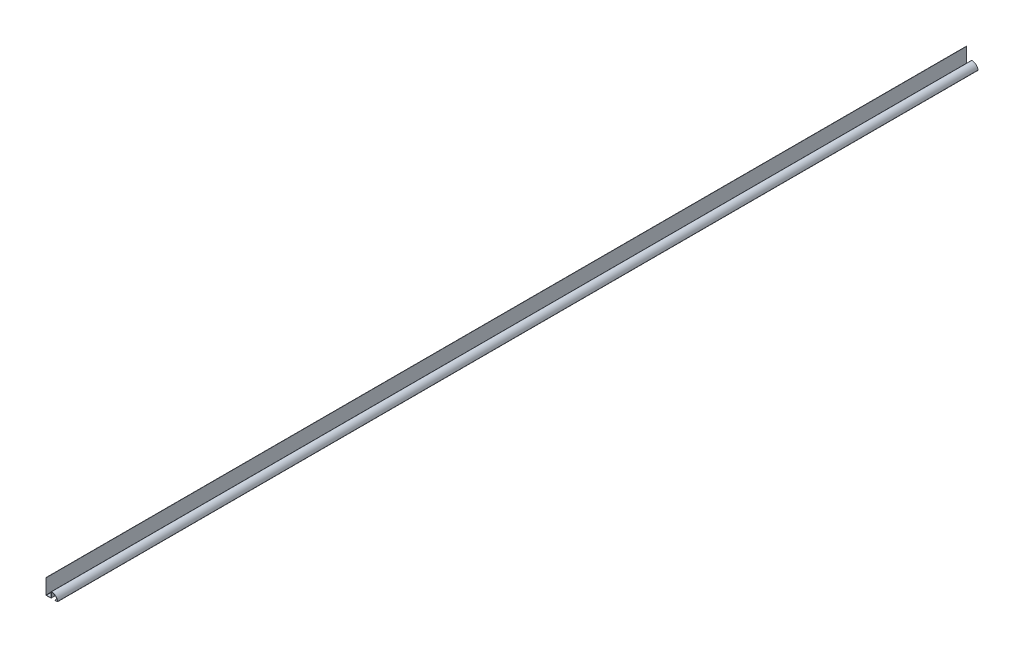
from build123d import *

# Parameters (mm, degrees)
EXTRUDE_THIN1_DEPTH = 2000


with BuildPart() as part:
    # Sketch1 → Extrude-Thin1 (new body)
    with BuildSketch(Plane.XY):
        with BuildLine():
            Line((19.05, 0.508), (24.38887696, 0.508))
            ThreePointArc((24.38887696, 0.508), (24.772111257, 0.682540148), (24.892, 1.086222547))
            ThreePointArc((24.892, 1.086222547), (20.587891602, 9.026875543), (12.1285, 12.192))
            ThreePointArc((12.1285, 12.192), (11.769289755, 12.043210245), (11.6205, 11.684))
            Line((11.6205, 11.684), (11.6205, 1))
            ThreePointArc((11.6205, 1), (11.327606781, 0.292893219), (10.6205, 0))
            Line((10.6205, 0), (1, 0))
            ThreePointArc((1, 0), (0.292893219, 0.292893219), (0, 1))
            Line((0, 1), (0, 33.3375))
            Line((0, 33.3375), (0.508, 33.3375))
            Line((0.508, 33.3375), (0.508, 1))
            ThreePointArc((0.508, 1), (0.652103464, 0.652103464), (1, 0.508))
            Line((1, 0.508), (10.6205, 0.508))
            ThreePointArc((10.6205, 0.508), (10.968396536, 0.652103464), (11.1125, 1))
            Line((11.1125, 1), (11.1125, 11.684))
            ThreePointArc((11.1125, 11.684), (11.41007951, 12.40242049), (12.1285, 12.7))
            ThreePointArc((12.1285, 12.7), (20.921351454, 9.410109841), (25.39512304, 1.156445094))
            ThreePointArc((25.39512304, 1.156445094), (25.155345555, 0.349080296), (24.38887696, 0))
            Line((24.38887696, 0), (19.05, 0))
            Line((19.05, 0), (19.05, 0.508))
        make_face()
    extrude(amount=-EXTRUDE_THIN1_DEPTH)


solid = part.part
